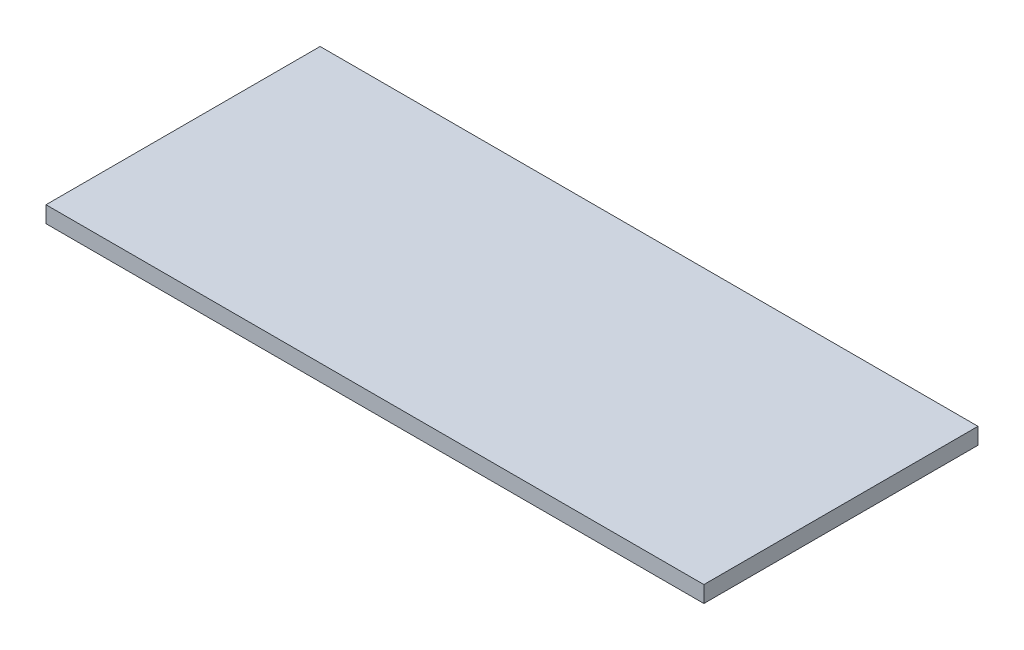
from build123d import *

# Parameters (mm, degrees)
SKETCH1_W           = 120
SKETCH1_H           = 50
BOSS_EXTRUDE1_DEPTH = 3


with BuildPart() as part:
    # Sketch1 → Boss-Extrude1 (new body)
    with BuildSketch(Plane(origin=(0, 0, 0), x_dir=(1, 0, 0), z_dir=(0, 1, 0))):
        Rectangle(SKETCH1_W, SKETCH1_H)
    extrude(amount=BOSS_EXTRUDE1_DEPTH)


solid = part.part
